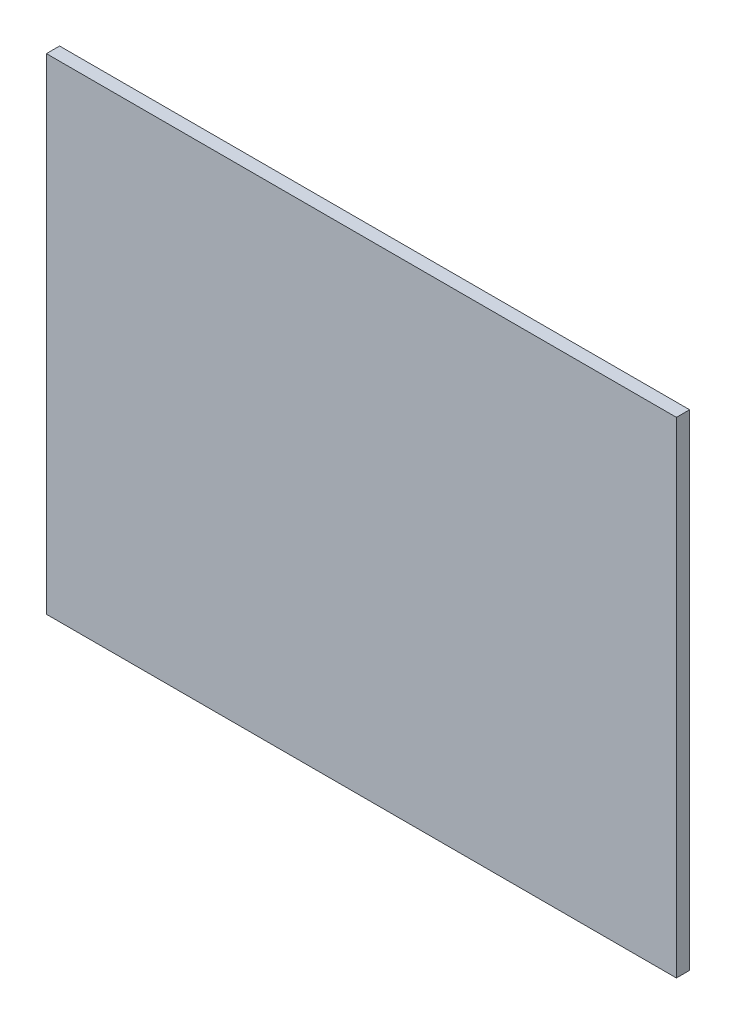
from build123d import *

# Parameters (mm, degrees)
ESQUISSE1_W        = 477.982124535
ESQUISSE1_H        = 368.387134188
BOSS_EXTRU_1_DEPTH = 10


with BuildPart() as part:
    # Esquisse1 → Boss.-Extru.1 (new body)
    with BuildSketch(Plane.XY):
        with Locations((238.991062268, -184.193567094)):
            Rectangle(ESQUISSE1_W, ESQUISSE1_H)
    extrude(amount=BOSS_EXTRU_1_DEPTH)


solid = part.part
